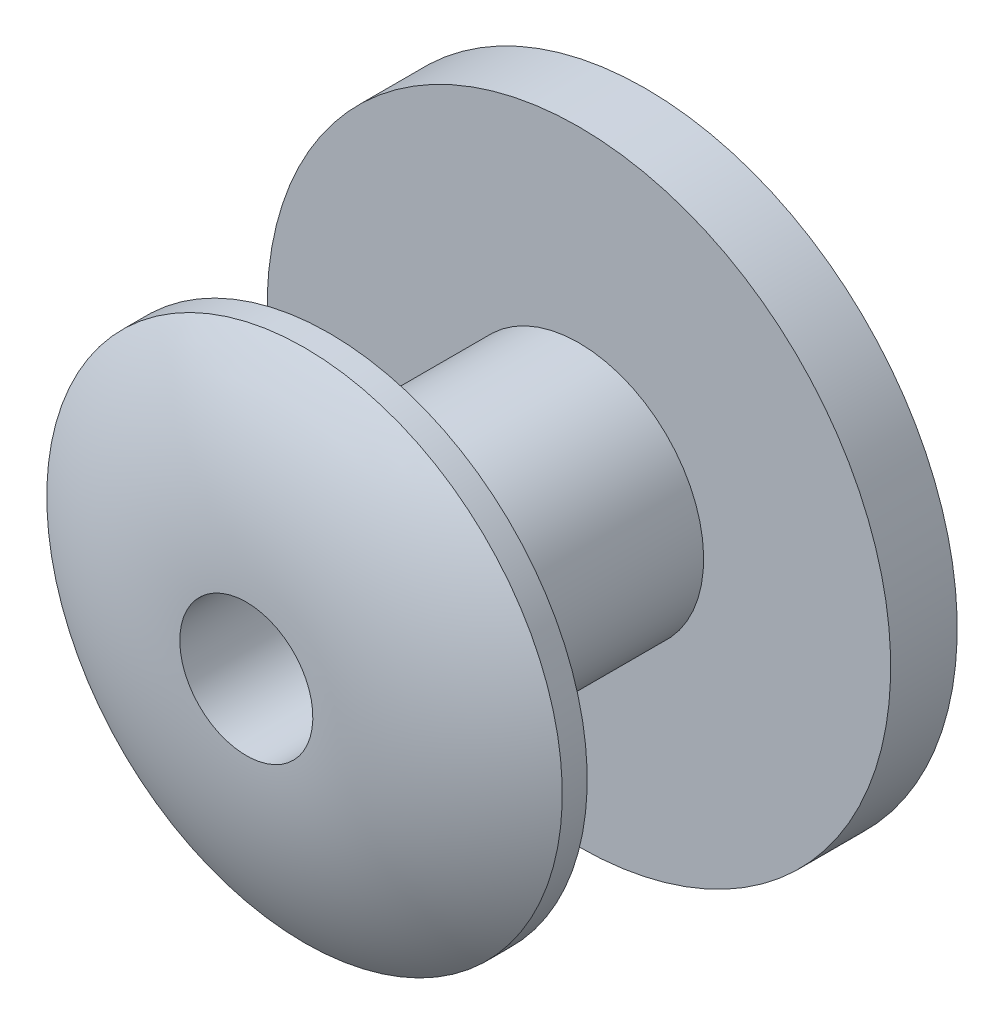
from build123d import *


with BuildPart() as part:
    # Sketch1 → Revolve1 (revolve)
    with BuildSketch(Plane(origin=(0, 0, 0), x_dir=(0, 0, -1), z_dir=(1, 0, 0))):
        with BuildLine():
            Line((-3.8, 3.1), (-3.8, 1.5))
            Line((-3.8, 1.5), (-0.8, 1.5))
            Line((-0.8, 1.5), (-0.8, 3.75))
            Line((-0.8, 3.75), (0, 3.75))
            Line((0, 3.75), (0, 0.8))
            Line((0, 0.8), (-4.8, 0.8))
            ThreePointArc((-4.8, 0.8), (-4.621125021, 2.002081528), (-4.1, 3.1))
            Line((-4.1, 3.1), (-3.8, 3.1))
        make_face()
    revolve(axis=Axis((0, 0, 0), (0, 0, 1)))


solid = part.part
